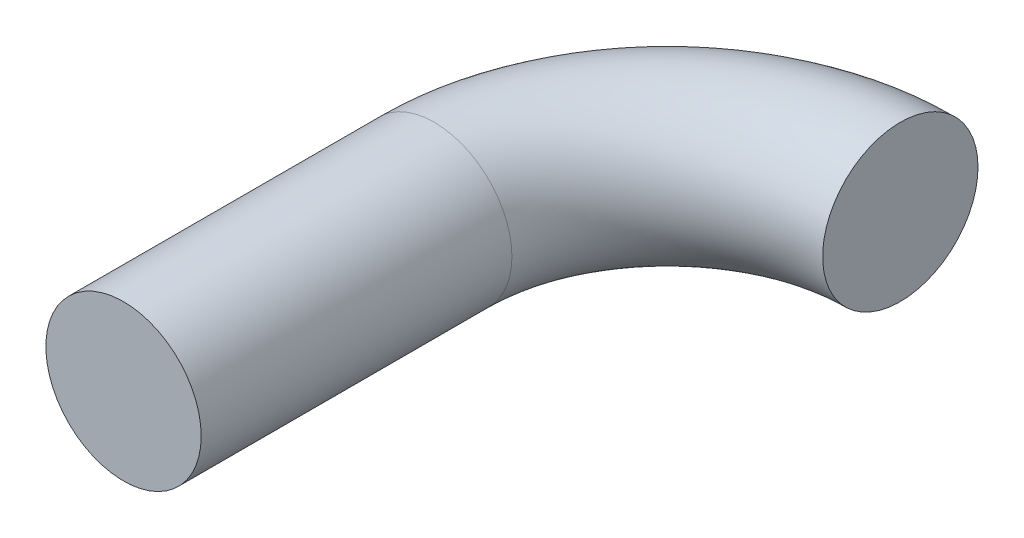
from build123d import *

# Parameters (mm, degrees)
SKETCH1_R = 25.4


with BuildPart() as part:
    # Sweep1: sweep along a path in Sketch2
    with BuildLine(Plane(origin=(0, 0, 0), x_dir=(1, 0, 0), z_dir=(0, 1, 0))) as sweep1_path:
        Line((0, 0), (0, 101.6))
        ThreePointArc((0, 101.6), (22.318463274, 155.481536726), (76.2, 177.8))
    # Sketch1 → Sweep1 (sweep)
    with BuildSketch(Plane.XY):
        Circle(SKETCH1_R)
    sweep(path=sweep1_path.line)


solid = part.part
